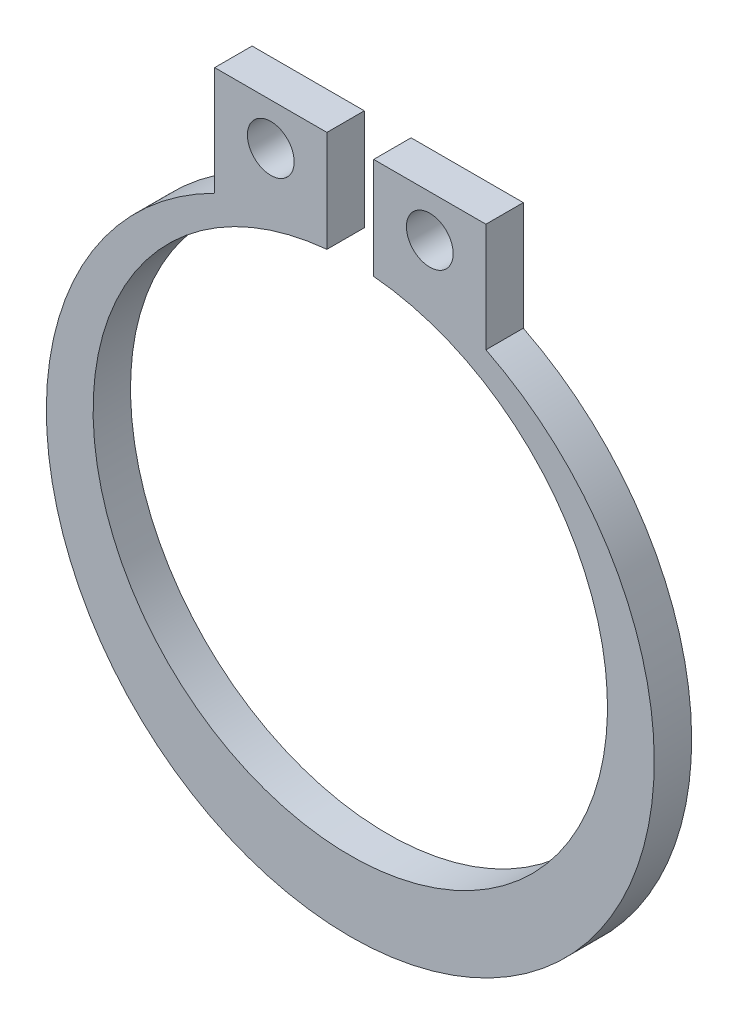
from build123d import *

# Parameters (mm, degrees)
ESQUISSE1_R          = 0.5
BASE_EXTRUSION_DEPTH = 0.8


with BuildPart() as part:
    # Esquisse1 → Base-Extrusion (new body)
    with BuildSketch(Plane.XY):
        with BuildLine():
            Line((-2.9, 7.643737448), (-0.5, 7.643737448))
            Line((-0.5, 7.643737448), (-0.5, 5.477225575))
            ThreePointArc((-0.5, 5.477225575), (0, -5.5), (0.5, 5.477225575))
            Line((0.5, 5.477225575), (0.5, 7.643737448))
            Line((0.5, 7.643737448), (2.9, 7.643737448))
            Line((2.9, 7.643737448), (2.9, 5.317215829))
            ThreePointArc((2.9, 5.317215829), (0, -7), (-2.9, 5.317215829))
            Line((-2.9, 5.317215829), (-2.9, 7.643737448))
        make_face()
        with Locations((-1.7, 6.747673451)):
            Circle(ESQUISSE1_R, mode=Mode.SUBTRACT)
        with Locations(Location((1.7, 6.747673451, 0), (0, 0, 180))):
            Circle(ESQUISSE1_R, mode=Mode.SUBTRACT)
    extrude(amount=BASE_EXTRUSION_DEPTH)


solid = part.part
